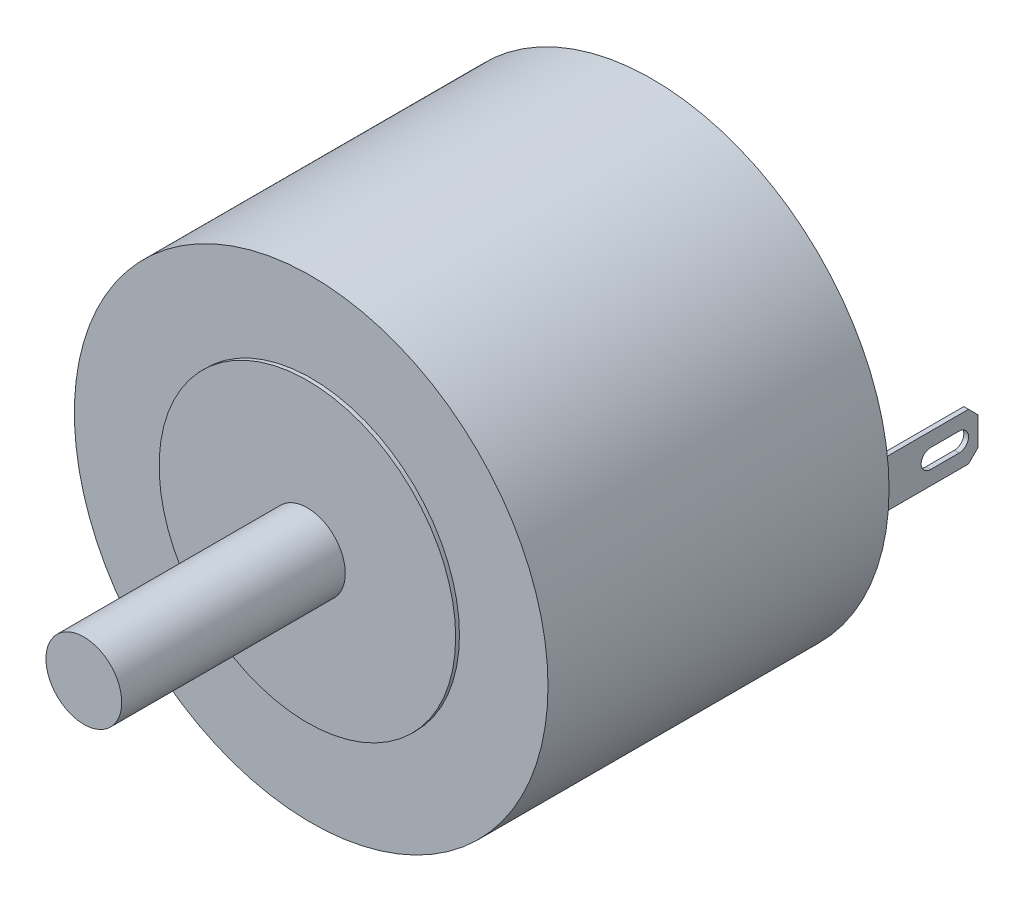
from build123d import *

# Parameters (mm, degrees)
SKETCH1_R                = 12.5
BOSS_EXTRUDE1_DEPTH      = 18
SKETCH1_4_R              = 5.217391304
SKETCH1_4_R_2            = 2
BOSS_EXTRUDE2_DEPTH      = 0.2
SKETCH1_5_R              = 7.826086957
SKETCH1_5_R_2            = 5.217391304
BOSS_EXTRUDE3_DEPTH      = 0.2
SKETCH3_R                = 4.5
BOSS_EXTRUDE4_DEPTH      = 1.5
SKETCH4_W                = 0.25
SKETCH4_H                = 2.5
BOSS_EXTRUDE5_DEPTH      = 5
BOSS_EXTRUDE5_2_DEPTH    = 5
CUT_EXTRUDE2_START       = -1
SKETCH4_5_R              = 11
SKETCH4_5_R_2            = 4.5
CUT_EXTRUDE2_DEPTH       = 1
CHAMFER1_SIZE            = 0.5
CHAMFER2_SIZE            = 0.5
CUT_EXTRUDE3_DEPTH       = 36.98724222
BOSS_EXTRUDE6_DEPTH      = 12
BOSS_EXTRUDE6_DEPTH_BACK = 20
SKETCH1_7_R              = 2


with BuildPart() as part:
    # Sketch1 → Boss-Extrude1 (new body)
    with BuildSketch(Plane.XY):
        Circle(SKETCH1_R)
    extrude(amount=-BOSS_EXTRUDE1_DEPTH)

    # Sketch1_4 → Boss-Extrude2 (add)
    with BuildSketch(Plane.XY):
        Circle(SKETCH1_4_R)
        Circle(SKETCH1_4_R_2, mode=Mode.SUBTRACT)
    extrude(amount=BOSS_EXTRUDE2_DEPTH)

    # Sketch1_5 → Boss-Extrude3 (add)
    with BuildSketch(Plane.XY):
        Circle(SKETCH1_5_R)
        Circle(SKETCH1_5_R_2, mode=Mode.SUBTRACT)
    extrude(amount=BOSS_EXTRUDE3_DEPTH)

    # Sketch3 → Boss-Extrude4 (add)
    with BuildSketch(Plane(origin=(0, 0, -18), x_dir=(-1, 0, 0), z_dir=(0, 0, -1))):
        Circle(SKETCH3_R)
    extrude(amount=BOSS_EXTRUDE4_DEPTH)

    # Sketch4_5 → Cut-Extrude2 (cut)
    with BuildSketch(Plane(origin=(0, 0, -18), x_dir=(-1, 0, 0), z_dir=(0, 0, -1)).offset(CUT_EXTRUDE2_START)):
        Circle(SKETCH4_5_R)
        Circle(SKETCH4_5_R_2, mode=Mode.SUBTRACT)
    extrude(amount=CUT_EXTRUDE2_DEPTH, mode=Mode.SUBTRACT)

    # Sketch1_7 → Boss-Extrude6 (add, two sides: drawn at the far end of the back side and taken through both)
    with BuildSketch(Plane.XY.offset(-BOSS_EXTRUDE6_DEPTH_BACK)):
        Circle(SKETCH1_7_R)
    extrude(amount=BOSS_EXTRUDE6_DEPTH + BOSS_EXTRUDE6_DEPTH_BACK)


with BuildPart() as body_2:
    # Sketch4 → Boss-Extrude5 (new body)
    with BuildSketch(Plane(origin=(0, 0, -18), x_dir=(-1, 0, 0), z_dir=(0, 0, -1))):
        with Locations((-12.069768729, 0)):
            Rectangle(SKETCH4_W, SKETCH4_H)
    extrude(amount=BOSS_EXTRUDE5_DEPTH)

    # Chamfer2
    chamfer2_edges = [body_2.edges().sort_by_distance(p)[0] for p in [
        (12.069768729, -1.25, -23),
        (12.069768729, 1.25, -23),
    ]]
    chamfer(chamfer2_edges, length=CHAMFER2_SIZE)


with BuildPart() as body_3:
    # Sketch4 → Boss-Extrude5 2 (new body)
    with BuildSketch(Plane(origin=(0, 0, -18), x_dir=(-1, 0, 0), z_dir=(0, 0, -1))):
        with Locations((12.069768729, 0)):
            Rectangle(SKETCH4_W, SKETCH4_H)
    extrude(amount=BOSS_EXTRUDE5_2_DEPTH)

    # Chamfer1
    chamfer1_edges = [body_3.edges().sort_by_distance(p)[0] for p in [
        (-12.069768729, -1.25, -23),
        (-12.069768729, 1.25, -23),
    ]]
    chamfer(chamfer1_edges, length=CHAMFER1_SIZE)


with BuildPart() as cut_extrude3_tool:
    # Sketch7 → Cut-Extrude3 (new, through all)
    with BuildSketch(Plane(origin=(12.194768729, 0, 0), x_dir=(0, 0, -1), z_dir=(1, 0, 0))):
        with BuildLine():
            Line((20.5, 0.5), (22, 0.5))
            ThreePointArc((22, 0.5), (22.5, 0), (22, -0.5))
            Line((22, -0.5), (20.5, -0.5))
            ThreePointArc((20.5, -0.5), (20, 0), (20.5, 0.5))
        make_face()
    extrude(amount=-CUT_EXTRUDE3_DEPTH)


with BuildPart() as body_2_1:
    add(body_2.part)

    # Cut-Extrude3: cut by cut_extrude3_tool
    add(cut_extrude3_tool.part, mode=Mode.SUBTRACT)


with BuildPart() as body_3_1:
    add(body_3.part)

    # Cut-Extrude3: cut by cut_extrude3_tool
    add(cut_extrude3_tool.part, mode=Mode.SUBTRACT)


solid = Compound([part.part, body_2_1.part, body_3_1.part])
